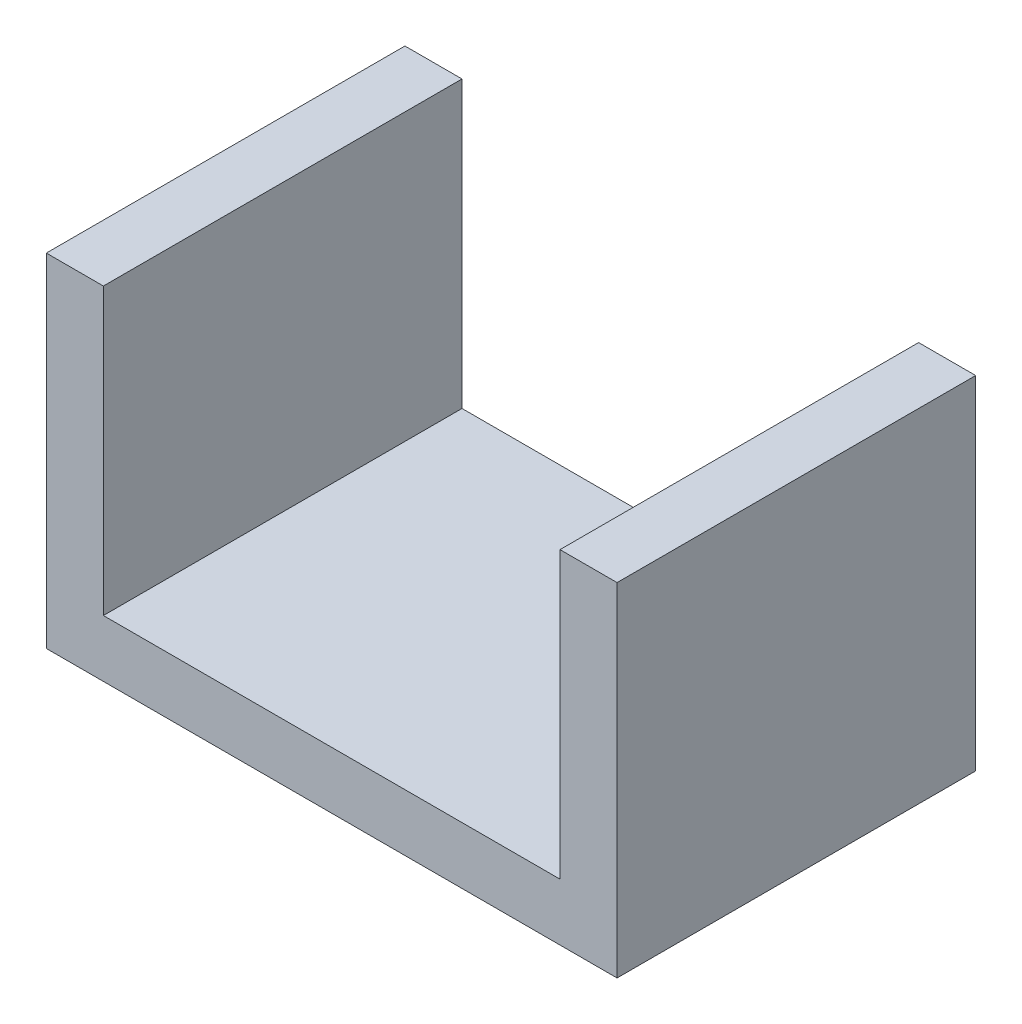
from build123d import *

# Parameters (mm, degrees)
EXTRUDE1_DEPTH = 31.417249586


with BuildPart() as part:
    # Sketch3 → Extrude1 (new, symmetric)
    with BuildSketch(Plane.XY):
        Polygon((-50, 60), (-50, 0), (50, 0), (50, 60), (40, 60), (40, 10), (-40, 10), (-40, 60), align=None)
    extrude(amount=EXTRUDE1_DEPTH, both=True)


solid = part.part
